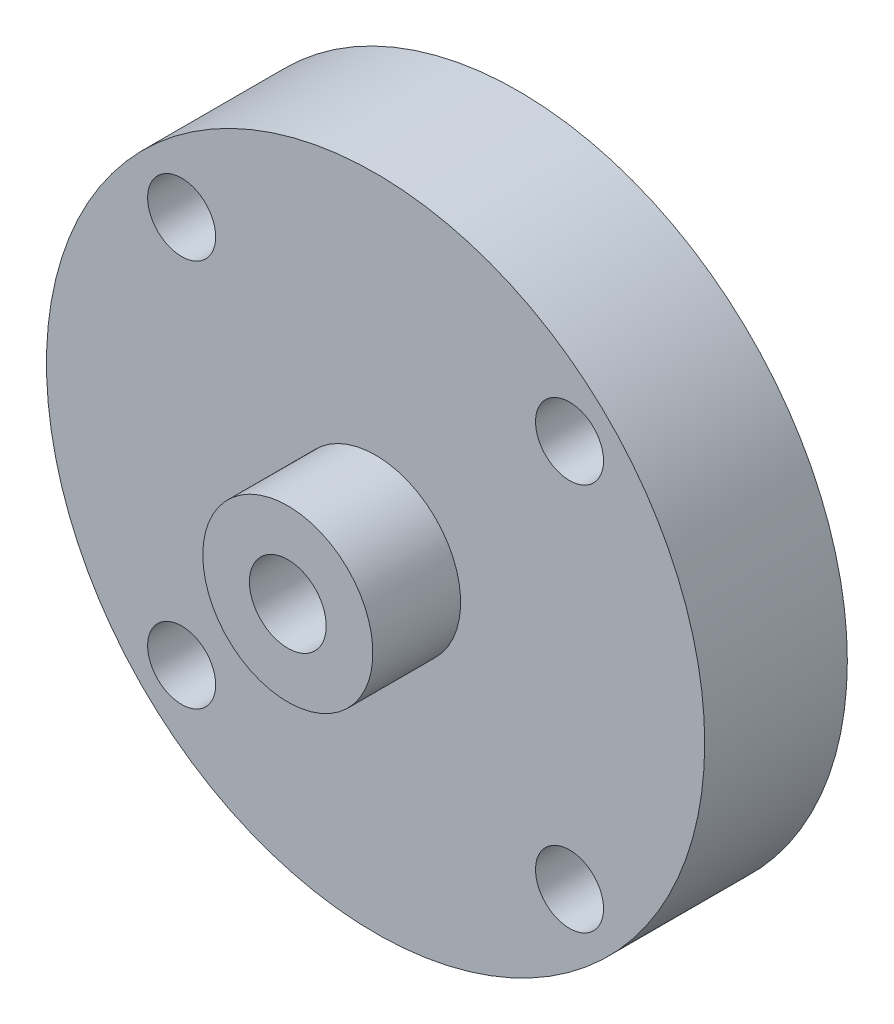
from build123d import *

# Parameters (mm, degrees)
CROQUIS1_R                 = 15
CROQUIS1_R_2               = 1.55
SALIENTE_EXTRUIR1_DEPTH    = 2
SALIENTE_EXTRUIR2_START    = 4.5
CROQUIS2_R                 = 15
CROQUIS2_R_2               = 3.875
CROQUIS2_R_3               = 1.55
SALIENTE_EXTRUIR2_DEPTH    = 4.5
SALIENTE_EXTRUIR3_START    = 8.5
CROQUIS3_R                 = 3.875
CROQUIS3_R_2               = 1.55
SALIENTE_EXTRUIR3_DEPTH    = 8.5
CROQUIS4_R                 = 2.875
CORTAR_EXTRUIR1_DEPTH      = 3.3
CORTAR_EXTRUIR2_DEPTH      = 174.842649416
CORTAR_EXTRUIR2_DEPTH_BACK = 174.842649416
CROQUIS5_R                 = 1.75


with BuildPart() as part:
    # Croquis1 → Saliente-Extruir1 (new body)
    with BuildSketch(Plane.XY):
        with Locations((0, 158.044580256)):
            Circle(CROQUIS1_R)
        with Locations((0, 158.044580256)):
            Circle(CROQUIS1_R_2, mode=Mode.SUBTRACT)
        with Locations((8.838834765, 149.205745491)):
            Circle(CROQUIS1_R_2, mode=Mode.SUBTRACT)
        with Locations((-8.838834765, 149.205745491)):
            Circle(CROQUIS1_R_2, mode=Mode.SUBTRACT)
        with Locations((-8.838834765, 166.88341502)):
            Circle(CROQUIS1_R_2, mode=Mode.SUBTRACT)
        with Locations((8.838834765, 166.88341502)):
            Circle(CROQUIS1_R_2, mode=Mode.SUBTRACT)
    extrude(amount=-SALIENTE_EXTRUIR1_DEPTH)

    # Croquis2 → Saliente-Extruir2 (add)
    with BuildSketch(Plane.XY.offset(SALIENTE_EXTRUIR2_START)):
        with Locations((0, 158.044580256)):
            Circle(CROQUIS2_R)
        with Locations((0, 158.044580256)):
            Circle(CROQUIS2_R_2, mode=Mode.SUBTRACT)
        with Locations((-8.838834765, 166.88341502)):
            Circle(CROQUIS2_R_3, mode=Mode.SUBTRACT)
        with Locations((8.838834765, 149.205745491)):
            Circle(CROQUIS2_R_3, mode=Mode.SUBTRACT)
        with Locations((-8.838834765, 149.205745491)):
            Circle(CROQUIS2_R_3, mode=Mode.SUBTRACT)
        with Locations((8.838834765, 166.88341502)):
            Circle(CROQUIS2_R_3, mode=Mode.SUBTRACT)
    extrude(amount=-SALIENTE_EXTRUIR2_DEPTH)

    # Croquis3 → Saliente-Extruir3 (add)
    with BuildSketch(Plane.XY.offset(SALIENTE_EXTRUIR3_START)):
        with Locations(Location((0, 158.044580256, 0), (0, 0, 180))):
            Circle(CROQUIS3_R)
        with Locations((0, 158.044580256)):
            Circle(CROQUIS3_R_2, mode=Mode.SUBTRACT)
    extrude(amount=-SALIENTE_EXTRUIR3_DEPTH)

    # Croquis4 → Cortar-Extruir1 (cut)
    with BuildSketch(Plane(origin=(0, 0, -2), x_dir=(-1, 0, 0), z_dir=(0, 0, -1))):
        with Locations((0, 158.044580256)):
            Circle(CROQUIS4_R)
    extrude(amount=-CORTAR_EXTRUIR1_DEPTH, mode=Mode.SUBTRACT)

    # Croquis5 → Cortar-Extruir2 (cut, two sides: drawn at the far end of the back side and taken through both)
    with BuildSketch(Plane(origin=(0, 0, 1.3), x_dir=(-1, 0, 0), z_dir=(0, 0, -1)).offset(-CORTAR_EXTRUIR2_DEPTH_BACK)):
        with Locations((0, 158.044580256)):
            Circle(CROQUIS5_R)
    extrude(amount=CORTAR_EXTRUIR2_DEPTH + CORTAR_EXTRUIR2_DEPTH_BACK, mode=Mode.SUBTRACT)


solid = part.part
